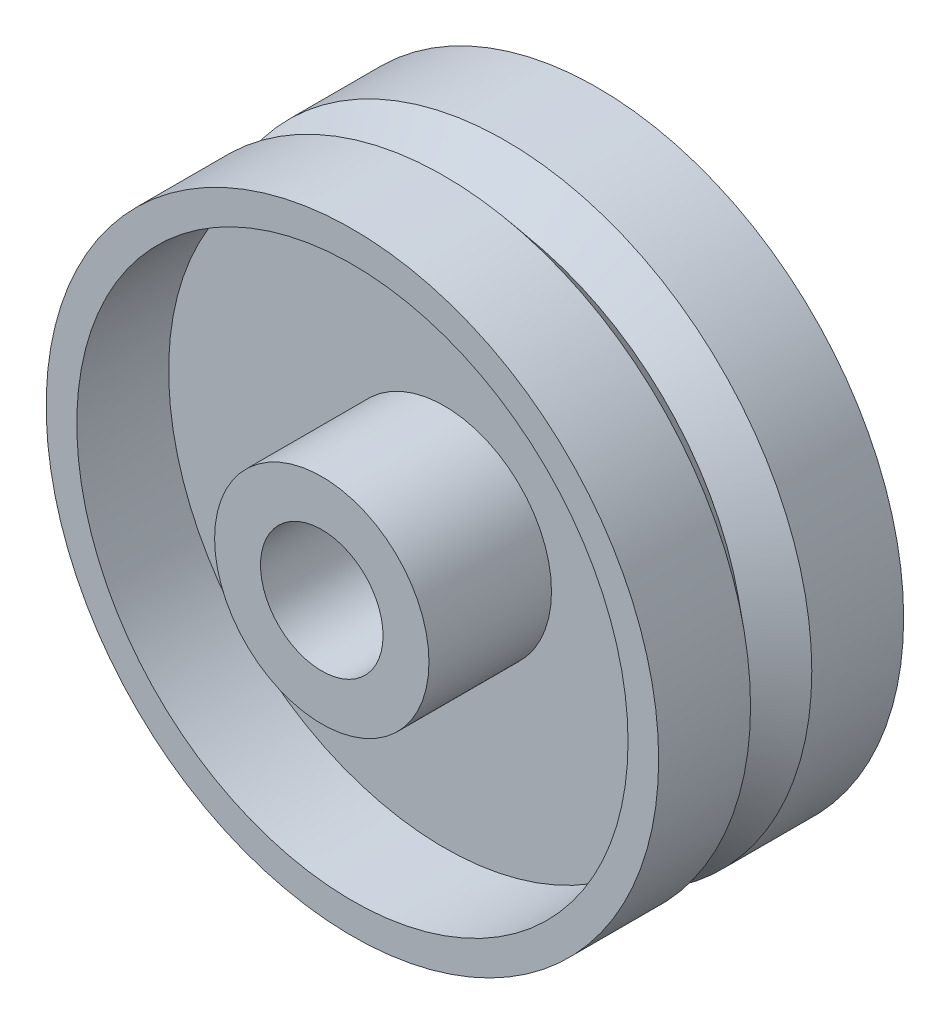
ISO-10303-21;
HEADER;
FILE_DESCRIPTION(('STEP AP214'),'2;1');
FILE_NAME('part.step','',(''),(''),'','','');
FILE_SCHEMA(('AUTOMOTIVE_DESIGN { 1 0 10303 214 1 1 1 1 }'));
ENDSEC;
DATA;
#1=APPLICATION_CONTEXT('core data for automotive mechanical design processes');
#2=APPLICATION_PROTOCOL_DEFINITION('international standard','automotive_design',2000,#1);
#3=PRODUCT_CONTEXT('',#1,'mechanical');
#4=PRODUCT('Part','Part','',(#3));
#5=PRODUCT_RELATED_PRODUCT_CATEGORY('part','',(#4));
#6=PRODUCT_DEFINITION_FORMATION('','',#4);
#7=PRODUCT_DEFINITION_CONTEXT('part definition',#1,'design');
#8=PRODUCT_DEFINITION('design','',#6,#7);
#9=PRODUCT_DEFINITION_SHAPE('','',#8);
#10=(LENGTH_UNIT() NAMED_UNIT(*) SI_UNIT(.MILLI.,.METRE.));
#11=(NAMED_UNIT(*) PLANE_ANGLE_UNIT() SI_UNIT($,.RADIAN.));
#12=(NAMED_UNIT(*) SI_UNIT($,.STERADIAN.) SOLID_ANGLE_UNIT());
#13=UNCERTAINTY_MEASURE_WITH_UNIT(LENGTH_MEASURE(1.E-05),#10,'distance_accuracy_value','');
#14=(GEOMETRIC_REPRESENTATION_CONTEXT(3) GLOBAL_UNCERTAINTY_ASSIGNED_CONTEXT((#13)) GLOBAL_UNIT_ASSIGNED_CONTEXT((#10,
#11,#12)) REPRESENTATION_CONTEXT('',''));
#15=CARTESIAN_POINT('',(0.,0.,0.));
#16=DIRECTION('',(0.,0.,1.));
#17=DIRECTION('',(1.,0.,0.));
#18=AXIS2_PLACEMENT_3D('',#15,#16,#17);
#19=CARTESIAN_POINT('',(0.,0.,0.));
#20=DIRECTION('',(0.,0.,1.));
#21=DIRECTION('',(1.,0.,0.));
#22=AXIS2_PLACEMENT_3D('',#19,#20,#21);
#23=CYLINDRICAL_SURFACE('',#22,50.);
#24=CARTESIAN_POINT('',(0.,0.,20.));
#25=DIRECTION('',(0.,0.,1.));
#26=DIRECTION('',(1.,0.,0.));
#27=AXIS2_PLACEMENT_3D('',#24,#25,#26);
#28=CIRCLE('',#27,50.);
#29=CARTESIAN_POINT('',(50.,0.,20.));
#30=VERTEX_POINT('',#29);
#31=EDGE_CURVE('E70',#30,#30,#28,.T.);
#32=ORIENTED_EDGE('',*,*,#31,.F.);
#33=EDGE_LOOP('',(#32));
#34=FACE_BOUND('',#33,.T.);
#35=CARTESIAN_POINT('',(0.,0.,5.));
#36=DIRECTION('',(0.,0.,1.));
#37=DIRECTION('',(1.,0.,0.));
#38=AXIS2_PLACEMENT_3D('',#35,#36,#37);
#39=CIRCLE('',#38,50.);
#40=CARTESIAN_POINT('',(50.,0.,5.));
#41=VERTEX_POINT('',#40);
#42=EDGE_CURVE('E91',#41,#41,#39,.T.);
#43=ORIENTED_EDGE('',*,*,#42,.T.);
#44=EDGE_LOOP('',(#43));
#45=FACE_BOUND('',#44,.T.);
#46=ADVANCED_FACE('F41',(#34,#45),#23,.T.);
#47=CARTESIAN_POINT('',(0.,0.,-20.));
#48=DIRECTION('',(0.,0.,1.));
#49=DIRECTION('',(1.,0.,0.));
#50=AXIS2_PLACEMENT_3D('',#47,#48,#49);
#51=CIRCLE('',#50,50.);
#52=CARTESIAN_POINT('',(50.,0.,-20.));
#53=VERTEX_POINT('',#52);
#54=EDGE_CURVE('E67',#53,#53,#51,.T.);
#55=ORIENTED_EDGE('',*,*,#54,.T.);
#56=EDGE_LOOP('',(#55));
#57=FACE_BOUND('',#56,.T.);
#58=CARTESIAN_POINT('',(0.,0.,-5.));
#59=DIRECTION('',(0.,0.,1.));
#60=DIRECTION('',(1.,0.,0.));
#61=AXIS2_PLACEMENT_3D('',#58,#59,#60);
#62=CIRCLE('',#61,50.);
#63=CARTESIAN_POINT('',(50.,0.,-5.));
#64=VERTEX_POINT('',#63);
#65=EDGE_CURVE('E88',#64,#64,#62,.T.);
#66=ORIENTED_EDGE('',*,*,#65,.F.);
#67=EDGE_LOOP('',(#66));
#68=FACE_BOUND('',#67,.T.);
#69=ADVANCED_FACE('F113',(#57,#68),#23,.T.);
#70=CARTESIAN_POINT('',(0.,17.5,25.));
#71=DIRECTION('',(0.,0.,-1.));
#72=DIRECTION('',(-1.,0.,0.));
#73=AXIS2_PLACEMENT_3D('',#70,#71,#72);
#74=PLANE('',#73);
#75=CARTESIAN_POINT('',(0.,0.,25.));
#76=DIRECTION('',(0.,0.,1.));
#77=DIRECTION('',(1.,0.,0.));
#78=AXIS2_PLACEMENT_3D('',#75,#76,#77);
#79=CIRCLE('',#78,10.);
#80=CARTESIAN_POINT('',(10.,0.,25.));
#81=VERTEX_POINT('',#80);
#82=EDGE_CURVE('E10',#81,#81,#79,.T.);
#83=ORIENTED_EDGE('',*,*,#82,.F.);
#84=EDGE_LOOP('',(#83));
#85=FACE_BOUND('',#84,.T.);
#86=CARTESIAN_POINT('',(0.,0.,25.));
#87=DIRECTION('',(0.,0.,1.));
#88=DIRECTION('',(1.,0.,0.));
#89=AXIS2_PLACEMENT_3D('',#86,#87,#88);
#90=CIRCLE('',#89,17.5);
#91=CARTESIAN_POINT('',(17.5,0.,25.));
#92=VERTEX_POINT('',#91);
#93=EDGE_CURVE('E82',#92,#92,#90,.T.);
#94=ORIENTED_EDGE('',*,*,#93,.T.);
#95=EDGE_LOOP('',(#94));
#96=FACE_BOUND('',#95,.T.);
#97=ADVANCED_FACE('F43',(#85,#96),#74,.F.);
#98=CARTESIAN_POINT('',(0.,0.,0.));
#99=DIRECTION('',(0.,0.,1.));
#100=DIRECTION('',(1.,0.,0.));
#101=AXIS2_PLACEMENT_3D('',#98,#99,#100);
#102=CYLINDRICAL_SURFACE('',#101,10.);
#103=CARTESIAN_POINT('',(0.,0.,-25.));
#104=DIRECTION('',(0.,0.,1.));
#105=DIRECTION('',(1.,0.,0.));
#106=AXIS2_PLACEMENT_3D('',#103,#104,#105);
#107=CIRCLE('',#106,10.);
#108=CARTESIAN_POINT('',(10.,0.,-25.));
#109=VERTEX_POINT('',#108);
#110=EDGE_CURVE('E48',#109,#109,#107,.T.);
#111=ORIENTED_EDGE('',*,*,#110,.F.);
#112=EDGE_LOOP('',(#111));
#113=FACE_BOUND('',#112,.T.);
#114=ORIENTED_EDGE('',*,*,#82,.T.);
#115=EDGE_LOOP('',(#114));
#116=FACE_BOUND('',#115,.T.);
#117=ADVANCED_FACE('F142',(#113,#116),#102,.F.);
#118=CARTESIAN_POINT('',(0.,10.,-25.));
#119=DIRECTION('',(0.,0.,1.));
#120=DIRECTION('',(1.,0.,0.));
#121=AXIS2_PLACEMENT_3D('',#118,#119,#120);
#122=PLANE('',#121);
#123=CARTESIAN_POINT('',(0.,0.,-25.));
#124=DIRECTION('',(0.,0.,1.));
#125=DIRECTION('',(1.,0.,0.));
#126=AXIS2_PLACEMENT_3D('',#123,#124,#125);
#127=CIRCLE('',#126,17.5);
#128=CARTESIAN_POINT('',(17.5,0.,-25.));
#129=VERTEX_POINT('',#128);
#130=EDGE_CURVE('E52',#129,#129,#127,.T.);
#131=ORIENTED_EDGE('',*,*,#130,.F.);
#132=EDGE_LOOP('',(#131));
#133=FACE_BOUND('',#132,.T.);
#134=ORIENTED_EDGE('',*,*,#110,.T.);
#135=EDGE_LOOP('',(#134));
#136=FACE_BOUND('',#135,.T.);
#137=ADVANCED_FACE('F139',(#133,#136),#122,.F.);
#138=CARTESIAN_POINT('',(0.,0.,0.));
#139=DIRECTION('',(0.,0.,1.));
#140=DIRECTION('',(1.,0.,0.));
#141=AXIS2_PLACEMENT_3D('',#138,#139,#140);
#142=CYLINDRICAL_SURFACE('',#141,17.5);
#143=CARTESIAN_POINT('',(0.,0.,-5.));
#144=DIRECTION('',(0.,0.,1.));
#145=DIRECTION('',(1.,0.,0.));
#146=AXIS2_PLACEMENT_3D('',#143,#144,#145);
#147=CIRCLE('',#146,17.5);
#148=CARTESIAN_POINT('',(17.5,0.,-5.));
#149=VERTEX_POINT('',#148);
#150=EDGE_CURVE('E56',#149,#149,#147,.T.);
#151=ORIENTED_EDGE('',*,*,#150,.F.);
#152=EDGE_LOOP('',(#151));
#153=FACE_BOUND('',#152,.T.);
#154=ORIENTED_EDGE('',*,*,#130,.T.);
#155=EDGE_LOOP('',(#154));
#156=FACE_BOUND('',#155,.T.);
#157=ADVANCED_FACE('F135',(#153,#156),#142,.T.);
#158=CARTESIAN_POINT('',(0.,17.5,-5.));
#159=DIRECTION('',(0.,0.,1.));
#160=DIRECTION('',(1.,0.,0.));
#161=AXIS2_PLACEMENT_3D('',#158,#159,#160);
#162=PLANE('',#161);
#163=CARTESIAN_POINT('',(0.,0.,-5.));
#164=DIRECTION('',(0.,0.,1.));
#165=DIRECTION('',(1.,0.,0.));
#166=AXIS2_PLACEMENT_3D('',#163,#164,#165);
#167=CIRCLE('',#166,45.);
#168=CARTESIAN_POINT('',(45.,0.,-5.));
#169=VERTEX_POINT('',#168);
#170=EDGE_CURVE('E61',#169,#169,#167,.T.);
#171=ORIENTED_EDGE('',*,*,#170,.F.);
#172=EDGE_LOOP('',(#171));
#173=FACE_BOUND('',#172,.T.);
#174=ORIENTED_EDGE('',*,*,#150,.T.);
#175=EDGE_LOOP('',(#174));
#176=FACE_BOUND('',#175,.T.);
#177=ADVANCED_FACE('F131',(#173,#176),#162,.F.);
#178=CARTESIAN_POINT('',(0.,0.,0.));
#179=DIRECTION('',(0.,0.,1.));
#180=DIRECTION('',(1.,0.,0.));
#181=AXIS2_PLACEMENT_3D('',#178,#179,#180);
#182=CYLINDRICAL_SURFACE('',#181,45.);
#183=CARTESIAN_POINT('',(0.,0.,-20.));
#184=DIRECTION('',(0.,0.,1.));
#185=DIRECTION('',(1.,0.,0.));
#186=AXIS2_PLACEMENT_3D('',#183,#184,#185);
#187=CIRCLE('',#186,45.);
#188=CARTESIAN_POINT('',(45.,0.,-20.));
#189=VERTEX_POINT('',#188);
#190=EDGE_CURVE('E64',#189,#189,#187,.T.);
#191=ORIENTED_EDGE('',*,*,#190,.F.);
#192=EDGE_LOOP('',(#191));
#193=FACE_BOUND('',#192,.T.);
#194=ORIENTED_EDGE('',*,*,#170,.T.);
#195=EDGE_LOOP('',(#194));
#196=FACE_BOUND('',#195,.T.);
#197=ADVANCED_FACE('F127',(#193,#196),#182,.F.);
#198=CARTESIAN_POINT('',(0.,45.,-20.));
#199=DIRECTION('',(0.,0.,1.));
#200=DIRECTION('',(1.,0.,0.));
#201=AXIS2_PLACEMENT_3D('',#198,#199,#200);
#202=PLANE('',#201);
#203=ORIENTED_EDGE('',*,*,#54,.F.);
#204=EDGE_LOOP('',(#203));
#205=FACE_BOUND('',#204,.T.);
#206=ORIENTED_EDGE('',*,*,#190,.T.);
#207=EDGE_LOOP('',(#206));
#208=FACE_BOUND('',#207,.T.);
#209=ADVANCED_FACE('F124',(#205,#208),#202,.F.);
#210=CARTESIAN_POINT('',(0.,50.,20.));
#211=DIRECTION('',(0.,0.,-1.));
#212=DIRECTION('',(-1.,0.,0.));
#213=AXIS2_PLACEMENT_3D('',#210,#211,#212);
#214=PLANE('',#213);
#215=CARTESIAN_POINT('',(0.,0.,20.));
#216=DIRECTION('',(0.,0.,1.));
#217=DIRECTION('',(1.,0.,0.));
#218=AXIS2_PLACEMENT_3D('',#215,#216,#217);
#219=CIRCLE('',#218,45.);
#220=CARTESIAN_POINT('',(45.,0.,20.));
#221=VERTEX_POINT('',#220);
#222=EDGE_CURVE('E73',#221,#221,#219,.T.);
#223=ORIENTED_EDGE('',*,*,#222,.F.);
#224=EDGE_LOOP('',(#223));
#225=FACE_BOUND('',#224,.T.);
#226=ORIENTED_EDGE('',*,*,#31,.T.);
#227=EDGE_LOOP('',(#226));
#228=FACE_BOUND('',#227,.T.);
#229=ADVANCED_FACE('F122',(#225,#228),#214,.F.);
#230=CARTESIAN_POINT('',(0.,0.,0.));
#231=DIRECTION('',(0.,0.,1.));
#232=DIRECTION('',(1.,0.,0.));
#233=AXIS2_PLACEMENT_3D('',#230,#231,#232);
#234=CYLINDRICAL_SURFACE('',#233,45.);
#235=CARTESIAN_POINT('',(0.,0.,5.));
#236=DIRECTION('',(0.,0.,1.));
#237=DIRECTION('',(1.,0.,0.));
#238=AXIS2_PLACEMENT_3D('',#235,#236,#237);
#239=CIRCLE('',#238,45.);
#240=CARTESIAN_POINT('',(45.,0.,5.));
#241=VERTEX_POINT('',#240);
#242=EDGE_CURVE('E76',#241,#241,#239,.T.);
#243=ORIENTED_EDGE('',*,*,#242,.F.);
#244=EDGE_LOOP('',(#243));
#245=FACE_BOUND('',#244,.T.);
#246=ORIENTED_EDGE('',*,*,#222,.T.);
#247=EDGE_LOOP('',(#246));
#248=FACE_BOUND('',#247,.T.);
#249=ADVANCED_FACE('F159',(#245,#248),#234,.F.);
#250=CARTESIAN_POINT('',(0.,45.,5.));
#251=DIRECTION('',(0.,0.,-1.));
#252=DIRECTION('',(-1.,0.,0.));
#253=AXIS2_PLACEMENT_3D('',#250,#251,#252);
#254=PLANE('',#253);
#255=CARTESIAN_POINT('',(0.,0.,5.));
#256=DIRECTION('',(0.,0.,1.));
#257=DIRECTION('',(1.,0.,0.));
#258=AXIS2_PLACEMENT_3D('',#255,#256,#257);
#259=CIRCLE('',#258,17.5);
#260=CARTESIAN_POINT('',(17.5,0.,5.));
#261=VERTEX_POINT('',#260);
#262=EDGE_CURVE('E79',#261,#261,#259,.T.);
#263=ORIENTED_EDGE('',*,*,#262,.F.);
#264=EDGE_LOOP('',(#263));
#265=FACE_BOUND('',#264,.T.);
#266=ORIENTED_EDGE('',*,*,#242,.T.);
#267=EDGE_LOOP('',(#266));
#268=FACE_BOUND('',#267,.T.);
#269=ADVANCED_FACE('F109',(#265,#268),#254,.F.);
#270=CARTESIAN_POINT('',(0.,0.,0.));
#271=DIRECTION('',(0.,0.,1.));
#272=DIRECTION('',(1.,0.,0.));
#273=AXIS2_PLACEMENT_3D('',#270,#271,#272);
#274=CYLINDRICAL_SURFACE('',#273,17.5);
#275=ORIENTED_EDGE('',*,*,#93,.F.);
#276=EDGE_LOOP('',(#275));
#277=FACE_BOUND('',#276,.T.);
#278=ORIENTED_EDGE('',*,*,#262,.T.);
#279=EDGE_LOOP('',(#278));
#280=FACE_BOUND('',#279,.T.);
#281=ADVANCED_FACE('F99',(#277,#280),#274,.T.);
#282=CARTESIAN_POINT('',(0.,0.,5.));
#283=DIRECTION('',(0.,0.,1.));
#284=DIRECTION('',(1.,0.,0.));
#285=AXIS2_PLACEMENT_3D('',#282,#283,#284);
#286=CONICAL_SURFACE('',#285,50.,0.872664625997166);
#287=CARTESIAN_POINT('',(0.,0.,0.));
#288=DIRECTION('',(0.,0.,1.));
#289=DIRECTION('',(1.,0.,0.));
#290=AXIS2_PLACEMENT_3D('',#287,#288,#289);
#291=CIRCLE('',#290,44.0412320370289);
#292=CARTESIAN_POINT('',(44.0412320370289,0.,0.));
#293=VERTEX_POINT('',#292);
#294=EDGE_CURVE('E85',#293,#293,#291,.T.);
#295=ORIENTED_EDGE('',*,*,#294,.T.);
#296=EDGE_LOOP('',(#295));
#297=FACE_BOUND('',#296,.T.);
#298=ORIENTED_EDGE('',*,*,#42,.F.);
#299=EDGE_LOOP('',(#298));
#300=FACE_BOUND('',#299,.T.);
#301=ADVANCED_FACE('F96',(#297,#300),#286,.T.);
#302=CARTESIAN_POINT('',(0.,0.,0.));
#303=DIRECTION('',(0.,0.,-1.));
#304=DIRECTION('',(-1.,0.,0.));
#305=AXIS2_PLACEMENT_3D('',#302,#303,#304);
#306=CONICAL_SURFACE('',#305,44.0412320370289,0.872664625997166);
#307=ORIENTED_EDGE('',*,*,#65,.T.);
#308=EDGE_LOOP('',(#307));
#309=FACE_BOUND('',#308,.T.);
#310=ORIENTED_EDGE('',*,*,#294,.F.);
#311=EDGE_LOOP('',(#310));
#312=FACE_BOUND('',#311,.T.);
#313=ADVANCED_FACE('F98',(#309,#312),#306,.T.);
#314=CLOSED_SHELL('',(#46,#69,#97,#117,#137,#157,#177,#197,#209,#229,#249,#269,#281,#301,#313));
#315=MANIFOLD_SOLID_BREP('B2',#314);
#316=ADVANCED_BREP_SHAPE_REPRESENTATION('',(#18,#315),#14);
#317=SHAPE_DEFINITION_REPRESENTATION(#9,#316);
ENDSEC;
END-ISO-10303-21;
